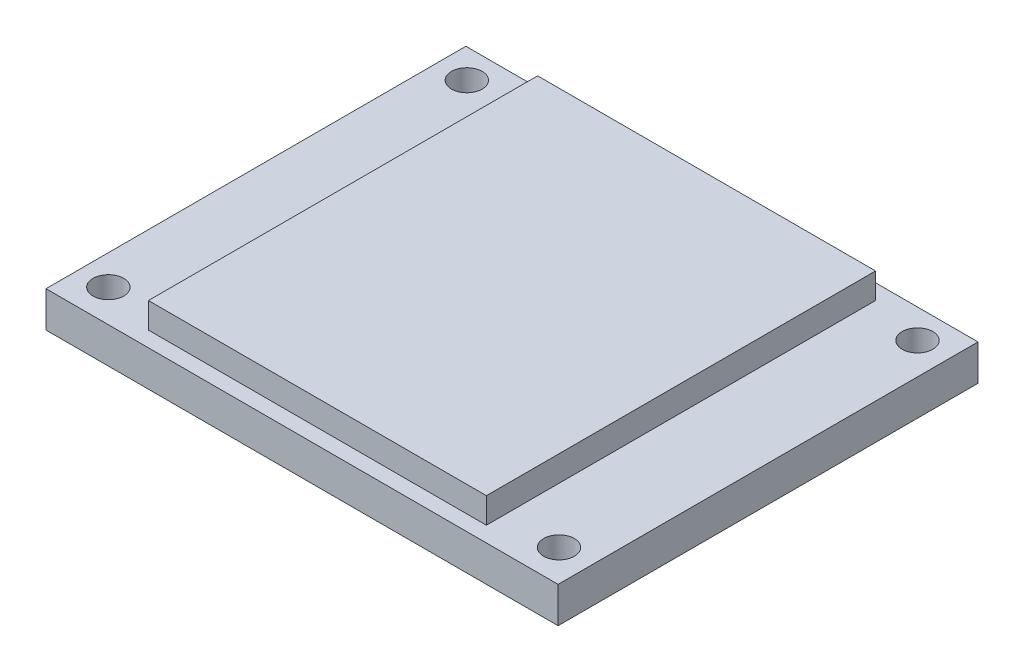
ISO-10303-21;
HEADER;
FILE_DESCRIPTION(('STEP AP214'),'2;1');
FILE_NAME('part.step','',(''),(''),'','','');
FILE_SCHEMA(('AUTOMOTIVE_DESIGN { 1 0 10303 214 1 1 1 1 }'));
ENDSEC;
DATA;
#1=APPLICATION_CONTEXT('core data for automotive mechanical design processes');
#2=APPLICATION_PROTOCOL_DEFINITION('international standard','automotive_design',2000,#1);
#3=PRODUCT_CONTEXT('',#1,'mechanical');
#4=PRODUCT('Part','Part','',(#3));
#5=PRODUCT_RELATED_PRODUCT_CATEGORY('part','',(#4));
#6=PRODUCT_DEFINITION_FORMATION('','',#4);
#7=PRODUCT_DEFINITION_CONTEXT('part definition',#1,'design');
#8=PRODUCT_DEFINITION('design','',#6,#7);
#9=PRODUCT_DEFINITION_SHAPE('','',#8);
#10=(LENGTH_UNIT() NAMED_UNIT(*) SI_UNIT(.MILLI.,.METRE.));
#11=(NAMED_UNIT(*) PLANE_ANGLE_UNIT() SI_UNIT($,.RADIAN.));
#12=(NAMED_UNIT(*) SI_UNIT($,.STERADIAN.) SOLID_ANGLE_UNIT());
#13=UNCERTAINTY_MEASURE_WITH_UNIT(LENGTH_MEASURE(1.E-05),#10,'distance_accuracy_value','');
#14=(GEOMETRIC_REPRESENTATION_CONTEXT(3) GLOBAL_UNCERTAINTY_ASSIGNED_CONTEXT((#13)) GLOBAL_UNIT_ASSIGNED_CONTEXT((#10,
#11,#12)) REPRESENTATION_CONTEXT('',''));
#15=CARTESIAN_POINT('',(0.,0.,0.));
#16=DIRECTION('',(0.,0.,1.));
#17=DIRECTION('',(1.,0.,0.));
#18=AXIS2_PLACEMENT_3D('',#15,#16,#17);
#19=CARTESIAN_POINT('',(0.,3.5,0.));
#20=DIRECTION('',(0.,1.,0.));
#21=DIRECTION('',(0.,0.,1.));
#22=AXIS2_PLACEMENT_3D('',#19,#20,#21);
#23=PLANE('',#22);
#24=CARTESIAN_POINT('',(-19.6623937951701,3.5,23.7965559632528));
#25=DIRECTION('',(0.,1.,0.));
#26=DIRECTION('',(0.,0.,1.));
#27=AXIS2_PLACEMENT_3D('',#24,#25,#26);
#28=CIRCLE('',#27,1.5);
#29=CARTESIAN_POINT('',(-19.6623937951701,3.5,25.2965559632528));
#30=VERTEX_POINT('',#29);
#31=EDGE_CURVE('E163',#30,#30,#28,.T.);
#32=ORIENTED_EDGE('',*,*,#31,.F.);
#33=EDGE_LOOP('',(#32));
#34=FACE_BOUND('',#33,.T.);
#35=CARTESIAN_POINT('',(24.3376062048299,3.5,-11.203342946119));
#36=DIRECTION('',(0.,1.,0.));
#37=DIRECTION('',(0.,0.,1.));
#38=AXIS2_PLACEMENT_3D('',#35,#36,#37);
#39=CIRCLE('',#38,1.5);
#40=CARTESIAN_POINT('',(24.3376062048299,3.5,-9.70334294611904));
#41=VERTEX_POINT('',#40);
#42=EDGE_CURVE('E156',#41,#41,#39,.T.);
#43=ORIENTED_EDGE('',*,*,#42,.F.);
#44=EDGE_LOOP('',(#43));
#45=FACE_BOUND('',#44,.T.);
#46=CARTESIAN_POINT('',(24.3376062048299,3.5,23.796657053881));
#47=DIRECTION('',(0.,1.,0.));
#48=DIRECTION('',(0.,0.,1.));
#49=AXIS2_PLACEMENT_3D('',#46,#47,#48);
#50=CIRCLE('',#49,1.5);
#51=CARTESIAN_POINT('',(24.3376062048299,3.5,25.296657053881));
#52=VERTEX_POINT('',#51);
#53=EDGE_CURVE('E144',#52,#52,#50,.T.);
#54=ORIENTED_EDGE('',*,*,#53,.F.);
#55=EDGE_LOOP('',(#54));
#56=FACE_BOUND('',#55,.T.);
#57=CARTESIAN_POINT('',(-19.6623937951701,3.5,-11.2034440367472));
#58=DIRECTION('',(0.,1.,0.));
#59=DIRECTION('',(0.,0.,1.));
#60=AXIS2_PLACEMENT_3D('',#57,#58,#59);
#61=CIRCLE('',#60,1.5);
#62=CARTESIAN_POINT('',(-19.6623937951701,3.5,-9.70344403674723));
#63=VERTEX_POINT('',#62);
#64=EDGE_CURVE('E162',#63,#63,#61,.T.);
#65=ORIENTED_EDGE('',*,*,#64,.F.);
#66=EDGE_LOOP('',(#65));
#67=FACE_BOUND('',#66,.T.);
#68=DIRECTION('',(0.,0.,1.));
#69=VECTOR('',#68,1.);
#70=CARTESIAN_POINT('',(-22.5806451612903,3.5,-14.0322580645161));
#71=LINE('',#70,#69);
#72=CARTESIAN_POINT('',(-22.5806451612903,3.5,-14.0322580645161));
#73=VERTEX_POINT('',#72);
#74=CARTESIAN_POINT('',(-22.5806451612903,3.5,26.9677419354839));
#75=VERTEX_POINT('',#74);
#76=EDGE_CURVE('E182',#73,#75,#71,.T.);
#77=ORIENTED_EDGE('',*,*,#76,.T.);
#78=DIRECTION('',(1.,0.,0.));
#79=VECTOR('',#78,1.);
#80=CARTESIAN_POINT('',(-22.5806451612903,3.5,26.9677419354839));
#81=LINE('',#80,#79);
#82=CARTESIAN_POINT('',(27.4193548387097,3.5,26.9677419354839));
#83=VERTEX_POINT('',#82);
#84=EDGE_CURVE('E94',#75,#83,#81,.T.);
#85=ORIENTED_EDGE('',*,*,#84,.T.);
#86=DIRECTION('',(0.,0.,-1.));
#87=VECTOR('',#86,1.);
#88=CARTESIAN_POINT('',(27.4193548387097,3.5,-14.0322580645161));
#89=LINE('',#88,#87);
#90=CARTESIAN_POINT('',(27.4193548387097,3.5,-14.0322580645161));
#91=VERTEX_POINT('',#90);
#92=EDGE_CURVE('E187',#83,#91,#89,.T.);
#93=ORIENTED_EDGE('',*,*,#92,.T.);
#94=DIRECTION('',(-1.,0.,0.));
#95=VECTOR('',#94,1.);
#96=CARTESIAN_POINT('',(-22.5806451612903,3.5,-14.0322580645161));
#97=LINE('',#96,#95);
#98=EDGE_CURVE('E66',#91,#73,#97,.T.);
#99=ORIENTED_EDGE('',*,*,#98,.T.);
#100=EDGE_LOOP('',(#77,#85,#93,#99));
#101=FACE_BOUND('',#100,.T.);
#102=DIRECTION('',(1.,0.,0.));
#103=VECTOR('',#102,1.);
#104=CARTESIAN_POINT('',(-14.0806451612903,3.5,25.4677419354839));
#105=LINE('',#104,#103);
#106=CARTESIAN_POINT('',(-14.0806451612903,3.5,25.4677419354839));
#107=VERTEX_POINT('',#106);
#108=CARTESIAN_POINT('',(18.9193548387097,3.5,25.4677419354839));
#109=VERTEX_POINT('',#108);
#110=EDGE_CURVE('E375',#107,#109,#105,.T.);
#111=ORIENTED_EDGE('',*,*,#110,.F.);
#112=DIRECTION('',(0.,0.,1.));
#113=VECTOR('',#112,1.);
#114=CARTESIAN_POINT('',(-14.0806451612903,3.5,-12.5322580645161));
#115=LINE('',#114,#113);
#116=CARTESIAN_POINT('',(-14.0806451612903,3.5,-12.5322580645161));
#117=VERTEX_POINT('',#116);
#118=EDGE_CURVE('E141',#117,#107,#115,.T.);
#119=ORIENTED_EDGE('',*,*,#118,.F.);
#120=DIRECTION('',(-1.,0.,0.));
#121=VECTOR('',#120,1.);
#122=CARTESIAN_POINT('',(-14.0806451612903,3.5,-12.5322580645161));
#123=LINE('',#122,#121);
#124=CARTESIAN_POINT('',(18.9193548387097,3.5,-12.5322580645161));
#125=VERTEX_POINT('',#124);
#126=EDGE_CURVE('E137',#125,#117,#123,.T.);
#127=ORIENTED_EDGE('',*,*,#126,.F.);
#128=DIRECTION('',(0.,0.,-1.));
#129=VECTOR('',#128,1.);
#130=CARTESIAN_POINT('',(18.9193548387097,3.5,-12.5322580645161));
#131=LINE('',#130,#129);
#132=EDGE_CURVE('E371',#109,#125,#131,.T.);
#133=ORIENTED_EDGE('',*,*,#132,.F.);
#134=EDGE_LOOP('',(#111,#119,#127,#133));
#135=FACE_BOUND('',#134,.T.);
#136=ADVANCED_FACE('F41',(#34,#45,#56,#67,#101,#135),#23,.T.);
#137=CARTESIAN_POINT('',(-22.5806451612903,3.5,-14.0322580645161));
#138=DIRECTION('',(1.,0.,0.));
#139=DIRECTION('',(0.,0.,-1.));
#140=AXIS2_PLACEMENT_3D('',#137,#138,#139);
#141=PLANE('',#140);
#142=DIRECTION('',(0.,0.,1.));
#143=VECTOR('',#142,1.);
#144=CARTESIAN_POINT('',(-22.5806451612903,0.,-14.0322580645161));
#145=LINE('',#144,#143);
#146=CARTESIAN_POINT('',(-22.5806451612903,0.,-14.0322580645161));
#147=VERTEX_POINT('',#146);
#148=CARTESIAN_POINT('',(-22.5806451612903,0.,26.9677419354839));
#149=VERTEX_POINT('',#148);
#150=EDGE_CURVE('E178',#147,#149,#145,.T.);
#151=ORIENTED_EDGE('',*,*,#150,.T.);
#152=DIRECTION('',(0.,-1.,0.));
#153=VECTOR('',#152,1.);
#154=CARTESIAN_POINT('',(-22.5806451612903,3.5,26.9677419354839));
#155=LINE('',#154,#153);
#156=EDGE_CURVE('E11',#75,#149,#155,.T.);
#157=ORIENTED_EDGE('',*,*,#156,.F.);
#158=ORIENTED_EDGE('',*,*,#76,.F.);
#159=DIRECTION('',(0.,-1.,0.));
#160=VECTOR('',#159,1.);
#161=CARTESIAN_POINT('',(-22.5806451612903,3.5,-14.0322580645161));
#162=LINE('',#161,#160);
#163=EDGE_CURVE('E192',#73,#147,#162,.T.);
#164=ORIENTED_EDGE('',*,*,#163,.T.);
#165=EDGE_LOOP('',(#151,#157,#158,#164));
#166=FACE_BOUND('',#165,.T.);
#167=ADVANCED_FACE('F43',(#166),#141,.F.);
#168=CARTESIAN_POINT('',(-22.5806451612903,3.5,26.9677419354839));
#169=DIRECTION('',(0.,0.,-1.));
#170=DIRECTION('',(-1.,0.,0.));
#171=AXIS2_PLACEMENT_3D('',#168,#169,#170);
#172=PLANE('',#171);
#173=DIRECTION('',(1.,0.,0.));
#174=VECTOR('',#173,1.);
#175=CARTESIAN_POINT('',(-22.5806451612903,0.,26.9677419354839));
#176=LINE('',#175,#174);
#177=CARTESIAN_POINT('',(27.4193548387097,0.,26.9677419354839));
#178=VERTEX_POINT('',#177);
#179=EDGE_CURVE('E196',#149,#178,#176,.T.);
#180=ORIENTED_EDGE('',*,*,#179,.T.);
#181=DIRECTION('',(0.,-1.,0.));
#182=VECTOR('',#181,1.);
#183=CARTESIAN_POINT('',(27.4193548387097,3.5,26.9677419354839));
#184=LINE('',#183,#182);
#185=EDGE_CURVE('E50',#83,#178,#184,.T.);
#186=ORIENTED_EDGE('',*,*,#185,.F.);
#187=ORIENTED_EDGE('',*,*,#84,.F.);
#188=ORIENTED_EDGE('',*,*,#156,.T.);
#189=EDGE_LOOP('',(#180,#186,#187,#188));
#190=FACE_BOUND('',#189,.T.);
#191=ADVANCED_FACE('F231',(#190),#172,.F.);
#192=CARTESIAN_POINT('',(27.4193548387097,3.5,-14.0322580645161));
#193=DIRECTION('',(-1.,0.,0.));
#194=DIRECTION('',(0.,0.,1.));
#195=AXIS2_PLACEMENT_3D('',#192,#193,#194);
#196=PLANE('',#195);
#197=DIRECTION('',(0.,0.,-1.));
#198=VECTOR('',#197,1.);
#199=CARTESIAN_POINT('',(27.4193548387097,0.,-14.0322580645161));
#200=LINE('',#199,#198);
#201=CARTESIAN_POINT('',(27.4193548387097,0.,-14.0322580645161));
#202=VERTEX_POINT('',#201);
#203=EDGE_CURVE('E199',#178,#202,#200,.T.);
#204=ORIENTED_EDGE('',*,*,#203,.T.);
#205=DIRECTION('',(0.,-1.,0.));
#206=VECTOR('',#205,1.);
#207=CARTESIAN_POINT('',(27.4193548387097,3.5,-14.0322580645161));
#208=LINE('',#207,#206);
#209=EDGE_CURVE('E206',#91,#202,#208,.T.);
#210=ORIENTED_EDGE('',*,*,#209,.F.);
#211=ORIENTED_EDGE('',*,*,#92,.F.);
#212=ORIENTED_EDGE('',*,*,#185,.T.);
#213=EDGE_LOOP('',(#204,#210,#211,#212));
#214=FACE_BOUND('',#213,.T.);
#215=ADVANCED_FACE('F213',(#214),#196,.F.);
#216=CARTESIAN_POINT('',(-22.5806451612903,3.5,-14.0322580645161));
#217=DIRECTION('',(0.,0.,1.));
#218=DIRECTION('',(1.,0.,0.));
#219=AXIS2_PLACEMENT_3D('',#216,#217,#218);
#220=PLANE('',#219);
#221=DIRECTION('',(-1.,0.,0.));
#222=VECTOR('',#221,1.);
#223=CARTESIAN_POINT('',(-22.5806451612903,0.,-14.0322580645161));
#224=LINE('',#223,#222);
#225=EDGE_CURVE('E87',#202,#147,#224,.T.);
#226=ORIENTED_EDGE('',*,*,#225,.T.);
#227=ORIENTED_EDGE('',*,*,#163,.F.);
#228=ORIENTED_EDGE('',*,*,#98,.F.);
#229=ORIENTED_EDGE('',*,*,#209,.T.);
#230=EDGE_LOOP('',(#226,#227,#228,#229));
#231=FACE_BOUND('',#230,.T.);
#232=ADVANCED_FACE('F221',(#231),#220,.F.);
#233=CARTESIAN_POINT('',(0.,0.,0.));
#234=DIRECTION('',(0.,1.,0.));
#235=DIRECTION('',(0.,0.,1.));
#236=AXIS2_PLACEMENT_3D('',#233,#234,#235);
#237=PLANE('',#236);
#238=CARTESIAN_POINT('',(-19.6623937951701,0.,23.7965559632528));
#239=DIRECTION('',(0.,1.,0.));
#240=DIRECTION('',(0.,0.,1.));
#241=AXIS2_PLACEMENT_3D('',#238,#239,#240);
#242=CIRCLE('',#241,1.5);
#243=CARTESIAN_POINT('',(-19.6623937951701,0.,25.2965559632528));
#244=VERTEX_POINT('',#243);
#245=EDGE_CURVE('E158',#244,#244,#242,.T.);
#246=ORIENTED_EDGE('',*,*,#245,.T.);
#247=EDGE_LOOP('',(#246));
#248=FACE_BOUND('',#247,.T.);
#249=CARTESIAN_POINT('',(24.3376062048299,0.,-11.203342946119));
#250=DIRECTION('',(0.,1.,0.));
#251=DIRECTION('',(0.,0.,1.));
#252=AXIS2_PLACEMENT_3D('',#249,#250,#251);
#253=CIRCLE('',#252,1.5);
#254=CARTESIAN_POINT('',(24.3376062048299,0.,-9.70334294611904));
#255=VERTEX_POINT('',#254);
#256=EDGE_CURVE('E167',#255,#255,#253,.T.);
#257=ORIENTED_EDGE('',*,*,#256,.T.);
#258=EDGE_LOOP('',(#257));
#259=FACE_BOUND('',#258,.T.);
#260=CARTESIAN_POINT('',(24.3376062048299,0.,23.796657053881));
#261=DIRECTION('',(0.,1.,0.));
#262=DIRECTION('',(0.,0.,1.));
#263=AXIS2_PLACEMENT_3D('',#260,#261,#262);
#264=CIRCLE('',#263,1.5);
#265=CARTESIAN_POINT('',(24.3376062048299,0.,25.296657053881));
#266=VERTEX_POINT('',#265);
#267=EDGE_CURVE('E149',#266,#266,#264,.T.);
#268=ORIENTED_EDGE('',*,*,#267,.T.);
#269=EDGE_LOOP('',(#268));
#270=FACE_BOUND('',#269,.T.);
#271=CARTESIAN_POINT('',(-19.6623937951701,0.,-11.2034440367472));
#272=DIRECTION('',(0.,1.,0.));
#273=DIRECTION('',(0.,0.,1.));
#274=AXIS2_PLACEMENT_3D('',#271,#272,#273);
#275=CIRCLE('',#274,1.5);
#276=CARTESIAN_POINT('',(-19.6623937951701,0.,-9.70344403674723));
#277=VERTEX_POINT('',#276);
#278=EDGE_CURVE('E174',#277,#277,#275,.T.);
#279=ORIENTED_EDGE('',*,*,#278,.T.);
#280=EDGE_LOOP('',(#279));
#281=FACE_BOUND('',#280,.T.);
#282=ORIENTED_EDGE('',*,*,#150,.F.);
#283=ORIENTED_EDGE('',*,*,#225,.F.);
#284=ORIENTED_EDGE('',*,*,#203,.F.);
#285=ORIENTED_EDGE('',*,*,#179,.F.);
#286=EDGE_LOOP('',(#282,#283,#284,#285));
#287=FACE_BOUND('',#286,.T.);
#288=ADVANCED_FACE('F217',(#248,#259,#270,#281,#287),#237,.F.);
#289=CARTESIAN_POINT('',(-19.6623937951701,0.,-11.2034440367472));
#290=DIRECTION('',(0.,1.,0.));
#291=DIRECTION('',(0.,0.,1.));
#292=AXIS2_PLACEMENT_3D('',#289,#290,#291);
#293=CYLINDRICAL_SURFACE('',#292,1.5);
#294=ORIENTED_EDGE('',*,*,#278,.F.);
#295=EDGE_LOOP('',(#294));
#296=FACE_BOUND('',#295,.T.);
#297=ORIENTED_EDGE('',*,*,#64,.T.);
#298=EDGE_LOOP('',(#297));
#299=FACE_BOUND('',#298,.T.);
#300=ADVANCED_FACE('F228',(#296,#299),#293,.F.);
#301=CARTESIAN_POINT('',(24.3376062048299,0.,23.796657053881));
#302=DIRECTION('',(0.,1.,0.));
#303=DIRECTION('',(0.,0.,1.));
#304=AXIS2_PLACEMENT_3D('',#301,#302,#303);
#305=CYLINDRICAL_SURFACE('',#304,1.5);
#306=ORIENTED_EDGE('',*,*,#267,.F.);
#307=EDGE_LOOP('',(#306));
#308=FACE_BOUND('',#307,.T.);
#309=ORIENTED_EDGE('',*,*,#53,.T.);
#310=EDGE_LOOP('',(#309));
#311=FACE_BOUND('',#310,.T.);
#312=ADVANCED_FACE('F244',(#308,#311),#305,.F.);
#313=CARTESIAN_POINT('',(24.3376062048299,0.,-11.203342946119));
#314=DIRECTION('',(0.,1.,0.));
#315=DIRECTION('',(0.,0.,1.));
#316=AXIS2_PLACEMENT_3D('',#313,#314,#315);
#317=CYLINDRICAL_SURFACE('',#316,1.5);
#318=ORIENTED_EDGE('',*,*,#256,.F.);
#319=EDGE_LOOP('',(#318));
#320=FACE_BOUND('',#319,.T.);
#321=ORIENTED_EDGE('',*,*,#42,.T.);
#322=EDGE_LOOP('',(#321));
#323=FACE_BOUND('',#322,.T.);
#324=ADVANCED_FACE('F246',(#320,#323),#317,.F.);
#325=CARTESIAN_POINT('',(-19.6623937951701,0.,23.7965559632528));
#326=DIRECTION('',(0.,1.,0.));
#327=DIRECTION('',(0.,0.,1.));
#328=AXIS2_PLACEMENT_3D('',#325,#326,#327);
#329=CYLINDRICAL_SURFACE('',#328,1.5);
#330=ORIENTED_EDGE('',*,*,#245,.F.);
#331=EDGE_LOOP('',(#330));
#332=FACE_BOUND('',#331,.T.);
#333=ORIENTED_EDGE('',*,*,#31,.T.);
#334=EDGE_LOOP('',(#333));
#335=FACE_BOUND('',#334,.T.);
#336=ADVANCED_FACE('F249',(#332,#335),#329,.F.);
#337=CARTESIAN_POINT('',(-14.0806451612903,6.,-12.5322580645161));
#338=DIRECTION('',(1.,0.,0.));
#339=DIRECTION('',(0.,0.,-1.));
#340=AXIS2_PLACEMENT_3D('',#337,#338,#339);
#341=PLANE('',#340);
#342=ORIENTED_EDGE('',*,*,#118,.T.);
#343=DIRECTION('',(0.,-1.,0.));
#344=VECTOR('',#343,1.);
#345=CARTESIAN_POINT('',(-14.0806451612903,6.,25.4677419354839));
#346=LINE('',#345,#344);
#347=CARTESIAN_POINT('',(-14.0806451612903,6.,25.4677419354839));
#348=VERTEX_POINT('',#347);
#349=EDGE_CURVE('E120',#348,#107,#346,.T.);
#350=ORIENTED_EDGE('',*,*,#349,.F.);
#351=DIRECTION('',(0.,0.,1.));
#352=VECTOR('',#351,1.);
#353=CARTESIAN_POINT('',(-14.0806451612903,6.,-12.5322580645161));
#354=LINE('',#353,#352);
#355=CARTESIAN_POINT('',(-14.0806451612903,6.,-12.5322580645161));
#356=VERTEX_POINT('',#355);
#357=EDGE_CURVE('E128',#356,#348,#354,.T.);
#358=ORIENTED_EDGE('',*,*,#357,.F.);
#359=DIRECTION('',(0.,-1.,0.));
#360=VECTOR('',#359,1.);
#361=CARTESIAN_POINT('',(-14.0806451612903,6.,-12.5322580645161));
#362=LINE('',#361,#360);
#363=EDGE_CURVE('E367',#356,#117,#362,.T.);
#364=ORIENTED_EDGE('',*,*,#363,.T.);
#365=EDGE_LOOP('',(#342,#350,#358,#364));
#366=FACE_BOUND('',#365,.T.);
#367=ADVANCED_FACE('F139',(#366),#341,.F.);
#368=CARTESIAN_POINT('',(-14.0806451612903,6.,25.4677419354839));
#369=DIRECTION('',(0.,0.,-1.));
#370=DIRECTION('',(-1.,0.,0.));
#371=AXIS2_PLACEMENT_3D('',#368,#369,#370);
#372=PLANE('',#371);
#373=ORIENTED_EDGE('',*,*,#110,.T.);
#374=DIRECTION('',(0.,-1.,0.));
#375=VECTOR('',#374,1.);
#376=CARTESIAN_POINT('',(18.9193548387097,6.,25.4677419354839));
#377=LINE('',#376,#375);
#378=CARTESIAN_POINT('',(18.9193548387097,6.,25.4677419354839));
#379=VERTEX_POINT('',#378);
#380=EDGE_CURVE('E123',#379,#109,#377,.T.);
#381=ORIENTED_EDGE('',*,*,#380,.F.);
#382=DIRECTION('',(1.,0.,0.));
#383=VECTOR('',#382,1.);
#384=CARTESIAN_POINT('',(-14.0806451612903,6.,25.4677419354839));
#385=LINE('',#384,#383);
#386=EDGE_CURVE('E116',#348,#379,#385,.T.);
#387=ORIENTED_EDGE('',*,*,#386,.F.);
#388=ORIENTED_EDGE('',*,*,#349,.T.);
#389=EDGE_LOOP('',(#373,#381,#387,#388));
#390=FACE_BOUND('',#389,.T.);
#391=ADVANCED_FACE('F118',(#390),#372,.F.);
#392=CARTESIAN_POINT('',(18.9193548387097,6.,-12.5322580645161));
#393=DIRECTION('',(-1.,0.,0.));
#394=DIRECTION('',(0.,0.,1.));
#395=AXIS2_PLACEMENT_3D('',#392,#393,#394);
#396=PLANE('',#395);
#397=ORIENTED_EDGE('',*,*,#132,.T.);
#398=DIRECTION('',(0.,-1.,0.));
#399=VECTOR('',#398,1.);
#400=CARTESIAN_POINT('',(18.9193548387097,6.,-12.5322580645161));
#401=LINE('',#400,#399);
#402=CARTESIAN_POINT('',(18.9193548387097,6.,-12.5322580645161));
#403=VERTEX_POINT('',#402);
#404=EDGE_CURVE('E57',#403,#125,#401,.T.);
#405=ORIENTED_EDGE('',*,*,#404,.F.);
#406=DIRECTION('',(0.,0.,-1.));
#407=VECTOR('',#406,1.);
#408=CARTESIAN_POINT('',(18.9193548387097,6.,-12.5322580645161));
#409=LINE('',#408,#407);
#410=EDGE_CURVE('E127',#379,#403,#409,.T.);
#411=ORIENTED_EDGE('',*,*,#410,.F.);
#412=ORIENTED_EDGE('',*,*,#380,.T.);
#413=EDGE_LOOP('',(#397,#405,#411,#412));
#414=FACE_BOUND('',#413,.T.);
#415=ADVANCED_FACE('F261',(#414),#396,.F.);
#416=CARTESIAN_POINT('',(-14.0806451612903,6.,-12.5322580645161));
#417=DIRECTION('',(0.,0.,1.));
#418=DIRECTION('',(1.,0.,0.));
#419=AXIS2_PLACEMENT_3D('',#416,#417,#418);
#420=PLANE('',#419);
#421=ORIENTED_EDGE('',*,*,#126,.T.);
#422=ORIENTED_EDGE('',*,*,#363,.F.);
#423=DIRECTION('',(-1.,0.,0.));
#424=VECTOR('',#423,1.);
#425=CARTESIAN_POINT('',(-14.0806451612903,6.,-12.5322580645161));
#426=LINE('',#425,#424);
#427=EDGE_CURVE('E132',#403,#356,#426,.T.);
#428=ORIENTED_EDGE('',*,*,#427,.F.);
#429=ORIENTED_EDGE('',*,*,#404,.T.);
#430=EDGE_LOOP('',(#421,#422,#428,#429));
#431=FACE_BOUND('',#430,.T.);
#432=ADVANCED_FACE('F264',(#431),#420,.F.);
#433=CARTESIAN_POINT('',(0.,6.,0.));
#434=DIRECTION('',(0.,1.,0.));
#435=DIRECTION('',(0.,0.,1.));
#436=AXIS2_PLACEMENT_3D('',#433,#434,#435);
#437=PLANE('',#436);
#438=ORIENTED_EDGE('',*,*,#357,.T.);
#439=ORIENTED_EDGE('',*,*,#386,.T.);
#440=ORIENTED_EDGE('',*,*,#410,.T.);
#441=ORIENTED_EDGE('',*,*,#427,.T.);
#442=EDGE_LOOP('',(#438,#439,#440,#441));
#443=FACE_BOUND('',#442,.T.);
#444=ADVANCED_FACE('F131',(#443),#437,.T.);
#445=CLOSED_SHELL('',(#136,#167,#191,#215,#232,#288,#300,#312,#324,#336,#367,#391,#415,#432,#444));
#446=MANIFOLD_SOLID_BREP('B2',#445);
#447=ADVANCED_BREP_SHAPE_REPRESENTATION('',(#18,#446),#14);
#448=SHAPE_DEFINITION_REPRESENTATION(#9,#447);
ENDSEC;
END-ISO-10303-21;
